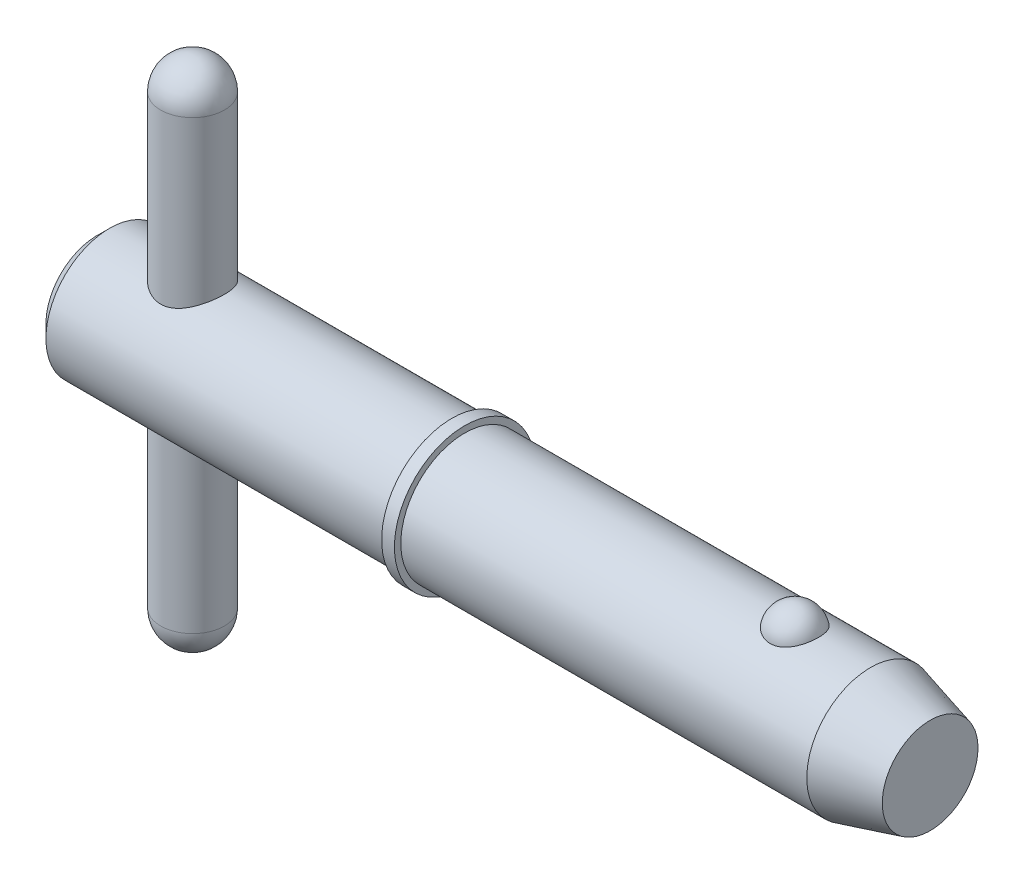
ISO-10303-21;
HEADER;
FILE_DESCRIPTION(('STEP AP214'),'2;1');
FILE_NAME('part.step','',(''),(''),'','','');
FILE_SCHEMA(('AUTOMOTIVE_DESIGN { 1 0 10303 214 1 1 1 1 }'));
ENDSEC;
DATA;
#1=APPLICATION_CONTEXT('core data for automotive mechanical design processes');
#2=APPLICATION_PROTOCOL_DEFINITION('international standard','automotive_design',2000,#1);
#3=PRODUCT_CONTEXT('',#1,'mechanical');
#4=PRODUCT('Part','Part','',(#3));
#5=PRODUCT_RELATED_PRODUCT_CATEGORY('part','',(#4));
#6=PRODUCT_DEFINITION_FORMATION('','',#4);
#7=PRODUCT_DEFINITION_CONTEXT('part definition',#1,'design');
#8=PRODUCT_DEFINITION('design','',#6,#7);
#9=PRODUCT_DEFINITION_SHAPE('','',#8);
#10=(LENGTH_UNIT() NAMED_UNIT(*) SI_UNIT(.MILLI.,.METRE.));
#11=(NAMED_UNIT(*) PLANE_ANGLE_UNIT() SI_UNIT($,.RADIAN.));
#12=(NAMED_UNIT(*) SI_UNIT($,.STERADIAN.) SOLID_ANGLE_UNIT());
#13=UNCERTAINTY_MEASURE_WITH_UNIT(LENGTH_MEASURE(1.E-05),#10,'distance_accuracy_value','');
#14=(GEOMETRIC_REPRESENTATION_CONTEXT(3) GLOBAL_UNCERTAINTY_ASSIGNED_CONTEXT((#13)) GLOBAL_UNIT_ASSIGNED_CONTEXT((#10,
#11,#12)) REPRESENTATION_CONTEXT('',''));
#15=CARTESIAN_POINT('',(0.,0.,0.));
#16=DIRECTION('',(0.,0.,1.));
#17=DIRECTION('',(1.,0.,0.));
#18=AXIS2_PLACEMENT_3D('',#15,#16,#17);
#19=CARTESIAN_POINT('',(4.755,12.7,0.));
#20=DIRECTION('',(0.,-1.,0.));
#21=DIRECTION('',(0.,0.,-1.));
#22=AXIS2_PLACEMENT_3D('',#19,#20,#21);
#23=CYLINDRICAL_SURFACE('',#22,1.585);
#24=CARTESIAN_POINT('',(4.755,-11.115,0.));
#25=DIRECTION('',(0.,-1.,0.));
#26=DIRECTION('',(0.,0.,-1.));
#27=AXIS2_PLACEMENT_3D('',#24,#25,#26);
#28=CIRCLE('',#27,1.585);
#29=CARTESIAN_POINT('',(4.755,-11.115,-1.585));
#30=VERTEX_POINT('',#29);
#31=EDGE_CURVE('P0_E10',#30,#30,#28,.F.);
#32=ORIENTED_EDGE('',*,*,#31,.T.);
#33=EDGE_LOOP('',(#32));
#34=FACE_BOUND('',#33,.T.);
#35=CARTESIAN_POINT('',(4.755,11.115,0.));
#36=DIRECTION('',(0.,-1.,0.));
#37=DIRECTION('',(0.,0.,-1.));
#38=AXIS2_PLACEMENT_3D('',#35,#36,#37);
#39=CIRCLE('',#38,1.585);
#40=CARTESIAN_POINT('',(4.755,11.115,-1.585));
#41=VERTEX_POINT('',#40);
#42=EDGE_CURVE('P0_E21',#41,#41,#39,.T.);
#43=ORIENTED_EDGE('',*,*,#42,.T.);
#44=EDGE_LOOP('',(#43));
#45=FACE_BOUND('',#44,.T.);
#46=ADVANCED_FACE('P0_F14',(#34,#45),#23,.T.);
#47=CARTESIAN_POINT('',(4.755,-11.115,0.));
#48=DIRECTION('',(0.,0.,1.));
#49=DIRECTION('',(1.,0.,0.));
#50=AXIS2_PLACEMENT_3D('',#47,#48,#49);
#51=SPHERICAL_SURFACE('',#50,1.585);
#52=CARTESIAN_POINT('',(4.755,-11.115,0.));
#53=DIRECTION('',(0.,-1.,0.));
#54=DIRECTION('',(0.,0.,-1.));
#55=AXIS2_PLACEMENT_3D('',#52,#53,#54);
#56=SPHERICAL_SURFACE('',#55,1.585);
#57=ORIENTED_EDGE('',*,*,#31,.F.);
#58=EDGE_LOOP('',(#57));
#59=FACE_BOUND('',#58,.T.);
#60=ADVANCED_FACE('P0_F29',(#59),#56,.T.);
#61=CARTESIAN_POINT('',(4.755,11.115,0.));
#62=DIRECTION('',(0.,0.,1.));
#63=DIRECTION('',(1.,0.,0.));
#64=AXIS2_PLACEMENT_3D('',#61,#62,#63);
#65=SPHERICAL_SURFACE('',#64,1.585);
#66=CARTESIAN_POINT('',(4.755,11.115,0.));
#67=DIRECTION('',(0.,-1.,0.));
#68=DIRECTION('',(0.,0.,-1.));
#69=AXIS2_PLACEMENT_3D('',#66,#67,#68);
#70=SPHERICAL_SURFACE('',#69,1.585);
#71=ORIENTED_EDGE('',*,*,#42,.F.);
#72=EDGE_LOOP('',(#71));
#73=FACE_BOUND('',#72,.T.);
#74=ADVANCED_FACE('P0_F16',(#73),#70,.T.);
#75=CLOSED_SHELL('',(#46,#60,#74));
#76=MANIFOLD_SOLID_BREP('P0_B1',#75);
#77=CARTESIAN_POINT('',(0.,0.,0.));
#78=DIRECTION('',(1.,0.,0.));
#79=DIRECTION('',(0.,0.,-1.));
#80=AXIS2_PLACEMENT_3D('',#77,#78,#79);
#81=CYLINDRICAL_SURFACE('',#80,3.175);
#82=CARTESIAN_POINT('',(38.4876846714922,0.,0.));
#83=DIRECTION('',(1.,0.,0.));
#84=DIRECTION('',(0.,0.,-1.));
#85=AXIS2_PLACEMENT_3D('',#82,#83,#84);
#86=CIRCLE('',#85,3.175);
#87=CARTESIAN_POINT('',(38.4876846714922,0.,-3.175));
#88=VERTEX_POINT('',#87);
#89=EDGE_CURVE('P1_E81',#88,#88,#86,.T.);
#90=ORIENTED_EDGE('',*,*,#89,.F.);
#91=EDGE_LOOP('',(#90));
#92=FACE_BOUND('',#91,.T.);
#93=CARTESIAN_POINT('',(18.29,0.,0.));
#94=DIRECTION('',(1.,0.,0.));
#95=DIRECTION('',(0.,0.,-1.));
#96=AXIS2_PLACEMENT_3D('',#93,#94,#95);
#97=CIRCLE('',#96,3.175);
#98=CARTESIAN_POINT('',(18.29,0.,-3.175));
#99=VERTEX_POINT('',#98);
#100=EDGE_CURVE('P1_E85',#99,#99,#97,.T.);
#101=ORIENTED_EDGE('',*,*,#100,.T.);
#102=EDGE_LOOP('',(#101));
#103=FACE_BOUND('',#102,.T.);
#104=CARTESIAN_POINT('',(34.7157276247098,2.92898950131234,1.22541646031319));
#105=CARTESIAN_POINT('',(34.652316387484,2.92899434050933,1.22541146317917));
#106=CARTESIAN_POINT('',(34.5887979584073,2.93112688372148,1.22034641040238));
#107=CARTESIAN_POINT('',(34.4635306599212,2.93942752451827,1.20020949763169));
#108=CARTESIAN_POINT('',(34.4017869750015,2.94560639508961,1.18511092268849));
#109=CARTESIAN_POINT('',(34.2820651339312,2.96127115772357,1.1454035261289));
#110=CARTESIAN_POINT('',(34.2240775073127,2.97074831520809,1.1208198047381));
#111=CARTESIAN_POINT('',(34.1131943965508,2.99197584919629,1.06285154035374));
#112=CARTESIAN_POINT('',(34.0602966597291,3.0037252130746,1.02947091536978));
#113=CARTESIAN_POINT('',(33.9592688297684,3.02865714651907,0.953674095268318));
#114=CARTESIAN_POINT('',(33.9113240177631,3.04187163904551,0.911021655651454));
#115=CARTESIAN_POINT('',(33.8230360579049,3.06808741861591,0.818400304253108));
#116=CARTESIAN_POINT('',(33.7826952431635,3.08108863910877,0.768429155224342));
#117=CARTESIAN_POINT('',(33.7088039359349,3.10614903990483,0.660064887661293));
#118=CARTESIAN_POINT('',(33.6756330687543,3.11814104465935,0.601396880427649));
#119=CARTESIAN_POINT('',(33.6191190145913,3.13926931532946,0.479026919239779));
#120=CARTESIAN_POINT('',(33.5957764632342,3.14840539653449,0.415324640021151));
#121=CARTESIAN_POINT('',(33.5591785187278,3.16298160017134,0.283885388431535));
#122=CARTESIAN_POINT('',(33.5460407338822,3.16837855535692,0.216110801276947));
#123=CARTESIAN_POINT('',(33.5305676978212,3.17475386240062,0.0791367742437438));
#124=CARTESIAN_POINT('',(33.528232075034,3.17573236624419,0.00993738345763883));
#125=CARTESIAN_POINT('',(33.5343886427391,3.17318075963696,-0.127420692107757));
#126=CARTESIAN_POINT('',(33.5428073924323,3.16968122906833,-0.195583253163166));
#127=CARTESIAN_POINT('',(33.5701752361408,3.1585790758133,-0.329413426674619));
#128=CARTESIAN_POINT('',(33.5891245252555,3.15097637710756,-0.395080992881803));
#129=CARTESIAN_POINT('',(33.6372057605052,3.13242485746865,-0.522180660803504));
#130=CARTESIAN_POINT('',(33.6663524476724,3.12147119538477,-0.583606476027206));
#131=CARTESIAN_POINT('',(33.7342352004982,3.09734973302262,-0.700436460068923));
#132=CARTESIAN_POINT('',(33.772972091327,3.08418174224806,-0.755840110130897));
#133=CARTESIAN_POINT('',(33.8594771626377,3.05694884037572,-0.85940454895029));
#134=CARTESIAN_POINT('',(33.9072961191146,3.04287919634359,-0.907521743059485));
#135=CARTESIAN_POINT('',(34.0107353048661,3.01548927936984,-0.994758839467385));
#136=CARTESIAN_POINT('',(34.0663549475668,3.0021689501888,-1.03387941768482));
#137=CARTESIAN_POINT('',(34.1828093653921,2.97810316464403,-1.10126594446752));
#138=CARTESIAN_POINT('',(34.2435182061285,2.96731170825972,-1.12973256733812));
#139=CARTESIAN_POINT('',(34.3693712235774,2.94928934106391,-1.17598467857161));
#140=CARTESIAN_POINT('',(34.4345137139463,2.94205708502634,-1.19377420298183));
#141=CARTESIAN_POINT('',(34.5638562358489,2.93233065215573,-1.21746387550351));
#142=CARTESIAN_POINT('',(34.6279385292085,2.92961621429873,-1.22391763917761));
#143=CARTESIAN_POINT('',(34.7563375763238,2.92855752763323,-1.22644976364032));
#144=CARTESIAN_POINT('',(34.8206542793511,2.93021238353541,-1.22253024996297));
#145=CARTESIAN_POINT('',(34.9455239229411,2.93756851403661,-1.20474140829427));
#146=CARTESIAN_POINT('',(35.006131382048,2.94313790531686,-1.1911962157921));
#147=CARTESIAN_POINT('',(35.1241106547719,2.95756226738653,-1.15491492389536));
#148=CARTESIAN_POINT('',(35.1814822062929,2.96641750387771,-1.13217808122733));
#149=CARTESIAN_POINT('',(35.2927699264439,2.98669918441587,-1.07755083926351));
#150=CARTESIAN_POINT('',(35.3465845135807,2.9981771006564,-1.04547308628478));
#151=CARTESIAN_POINT('',(35.4481473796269,3.02240235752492,-0.973220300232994));
#152=CARTESIAN_POINT('',(35.4958942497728,3.03514999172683,-0.933043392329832));
#153=CARTESIAN_POINT('',(35.5865817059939,3.06131230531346,-0.843372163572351));
#154=CARTESIAN_POINT('',(35.6291588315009,3.07472822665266,-0.793510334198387));
#155=CARTESIAN_POINT('',(35.7056765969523,3.10021106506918,-0.687241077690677));
#156=CARTESIAN_POINT('',(35.7396156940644,3.1122777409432,-0.630832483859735));
#157=CARTESIAN_POINT('',(35.7991209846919,3.134208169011,-0.511059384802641));
#158=CARTESIAN_POINT('',(35.8243892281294,3.14399040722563,-0.447531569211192));
#159=CARTESIAN_POINT('',(35.8645117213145,3.15983820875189,-0.316827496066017));
#160=CARTESIAN_POINT('',(35.8793659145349,3.16590375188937,-0.249651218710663));
#161=CARTESIAN_POINT('',(35.898358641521,3.17370076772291,-0.113549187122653));
#162=CARTESIAN_POINT('',(35.9024966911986,3.17543204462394,-0.044623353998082));
#163=CARTESIAN_POINT('',(35.8999697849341,3.17438372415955,0.0929938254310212));
#164=CARTESIAN_POINT('',(35.893305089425,3.17160423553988,0.161685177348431));
#165=CARTESIAN_POINT('',(35.8693754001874,3.1618438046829,0.296502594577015));
#166=CARTESIAN_POINT('',(35.8521674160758,3.15488546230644,0.36264043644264));
#167=CARTESIAN_POINT('',(35.807547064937,3.13748892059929,0.490896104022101));
#168=CARTESIAN_POINT('',(35.7801339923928,3.12705048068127,0.553013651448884));
#169=CARTESIAN_POINT('',(35.7154626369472,3.10369139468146,0.671876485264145));
#170=CARTESIAN_POINT('',(35.6781467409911,3.0907563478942,0.728587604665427));
#171=CARTESIAN_POINT('',(35.5945246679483,3.06381731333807,0.834653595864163));
#172=CARTESIAN_POINT('',(35.5482189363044,3.04981337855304,0.884008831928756));
#173=CARTESIAN_POINT('',(35.4477184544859,3.02230423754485,0.973916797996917));
#174=CARTESIAN_POINT('',(35.393535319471,3.00879833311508,1.01448227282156));
#175=CARTESIAN_POINT('',(35.2785299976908,2.98383625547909,1.08571550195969));
#176=CARTESIAN_POINT('',(35.2177053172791,2.97238085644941,1.11637952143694));
#177=CARTESIAN_POINT('',(35.0933690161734,2.95329063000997,1.16592590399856));
#178=CARTESIAN_POINT('',(35.0300230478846,2.94553738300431,1.1851790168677));
#179=CARTESIAN_POINT('',(34.9007664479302,2.9342556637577,1.21284802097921));
#180=CARTESIAN_POINT('',(34.8348641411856,2.93071450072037,1.22129647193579));
#181=CARTESIAN_POINT('',(34.751116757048,2.9291525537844,1.22502505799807));
#182=CARTESIAN_POINT('',(34.7334263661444,2.9289881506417,1.22541785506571));
#183=CARTESIAN_POINT('',(34.7157276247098,2.92898950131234,1.22541646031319));
#184=B_SPLINE_CURVE_WITH_KNOTS('',3,(#104,#105,#106,#107,#108,#109,#110,#111,#112,#113,#114,
#115,#116,#117,#118,#119,#120,#121,#122,#123,#124,#125,#126,#127,#128,#129,#130,#131,#132,#133,
#134,#135,#136,#137,#138,#139,#140,#141,#142,#143,#144,#145,#146,#147,#148,#149,#150,#151,#152,
#153,#154,#155,#156,#157,#158,#159,#160,#161,#162,#163,#164,#165,#166,#167,#168,#169,#170,#171,
#172,#173,#174,#175,#176,#177,#178,#179,#180,#181,#182,#183),.UNSPECIFIED.,.T.,.F.,(4,2,2,2,2,2,
2,2,2,2,2,2,2,2,2,2,2,2,2,2,2,2,2,2,2,2,2,2,2,2,2,2,2,2,2,2,2,2,2,4),(0.,0.190186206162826,
0.380880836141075,0.571074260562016,0.761183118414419,0.956866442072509,1.15260970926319,
1.35701770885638,1.56143892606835,1.76818248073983,1.9749189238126,2.18025109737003,
2.38558707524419,2.59122111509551,2.79687285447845,3.00371012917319,3.21053185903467,
3.41323429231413,3.61586005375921,3.80828192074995,4.00066436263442,4.18685798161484,
4.37306665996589,4.5633030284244,4.75358348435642,4.95345287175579,5.15335793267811,
5.3595700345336,5.56578325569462,5.77200579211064,5.97822335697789,6.18333558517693,
6.38846199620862,6.59480900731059,6.8011457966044,7.00718137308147,7.21329457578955,
7.41228022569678,7.61066481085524,7.6637477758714),.UNSPECIFIED.);
#185=CARTESIAN_POINT('',(34.7157276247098,2.92898950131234,1.22541646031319));
#186=VERTEX_POINT('',#185);
#187=EDGE_CURVE('P1_E35',#186,#186,#184,.T.);
#188=ORIENTED_EDGE('',*,*,#187,.T.);
#189=EDGE_LOOP('',(#188));
#190=FACE_BOUND('',#189,.T.);
#191=ADVANCED_FACE('P1_F13',(#92,#103,#190),#81,.T.);
#192=CARTESIAN_POINT('',(0.,0.,0.));
#193=DIRECTION('',(-1.,0.,0.));
#194=DIRECTION('',(0.,0.,1.));
#195=AXIS2_PLACEMENT_3D('',#192,#193,#194);
#196=PLANE('',#195);
#197=CARTESIAN_POINT('',(0.,0.,0.));
#198=DIRECTION('',(1.,0.,0.));
#199=DIRECTION('',(0.,0.,-1.));
#200=AXIS2_PLACEMENT_3D('',#197,#198,#199);
#201=CIRCLE('',#200,2.54);
#202=CARTESIAN_POINT('',(0.,0.,-2.54));
#203=VERTEX_POINT('',#202);
#204=EDGE_CURVE('P1_E9',#203,#203,#201,.T.);
#205=ORIENTED_EDGE('',*,*,#204,.F.);
#206=EDGE_LOOP('',(#205));
#207=FACE_BOUND('',#206,.T.);
#208=ADVANCED_FACE('P1_F15',(#207),#196,.T.);
#209=CARTESIAN_POINT('',(0.634999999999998,0.,0.));
#210=DIRECTION('',(1.,0.,0.));
#211=DIRECTION('',(0.,0.,-1.));
#212=AXIS2_PLACEMENT_3D('',#209,#210,#211);
#213=CONICAL_SURFACE('',#212,3.175,0.78539816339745);
#214=ORIENTED_EDGE('',*,*,#204,.T.);
#215=EDGE_LOOP('',(#214));
#216=FACE_BOUND('',#215,.T.);
#217=CARTESIAN_POINT('',(0.634999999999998,0.,0.));
#218=DIRECTION('',(1.,0.,0.));
#219=DIRECTION('',(0.,0.,-1.));
#220=AXIS2_PLACEMENT_3D('',#217,#218,#219);
#221=CIRCLE('',#220,3.175);
#222=CARTESIAN_POINT('',(0.634999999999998,0.,-3.175));
#223=VERTEX_POINT('',#222);
#224=EDGE_CURVE('P1_E26',#223,#223,#221,.T.);
#225=ORIENTED_EDGE('',*,*,#224,.F.);
#226=EDGE_LOOP('',(#225));
#227=FACE_BOUND('',#226,.T.);
#228=ADVANCED_FACE('P1_F77',(#216,#227),#213,.T.);
#229=CARTESIAN_POINT('',(0.,0.,0.));
#230=DIRECTION('',(1.,0.,0.));
#231=DIRECTION('',(0.,0.,-1.));
#232=AXIS2_PLACEMENT_3D('',#229,#230,#231);
#233=CYLINDRICAL_SURFACE('',#232,3.175);
#234=CARTESIAN_POINT('',(4.755,-2.75107251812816,1.585));
#235=CARTESIAN_POINT('',(4.67238891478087,-2.7510796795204,1.58499425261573));
#236=CARTESIAN_POINT('',(4.58967306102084,-2.75485010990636,1.57849830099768));
#237=CARTESIAN_POINT('',(4.42677850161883,-2.76938647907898,1.55284486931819));
#238=CARTESIAN_POINT('',(4.34660551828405,-2.78016716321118,1.53366069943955));
#239=CARTESIAN_POINT('',(4.19146029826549,-2.80716278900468,1.48366329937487));
#240=CARTESIAN_POINT('',(4.11646293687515,-2.8233488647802,1.45291173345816));
#241=CARTESIAN_POINT('',(3.97271079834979,-2.85928672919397,1.38084067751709));
#242=CARTESIAN_POINT('',(3.90395634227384,-2.87903870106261,1.33952064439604));
#243=CARTESIAN_POINT('',(3.76839976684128,-2.921867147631,1.24350234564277));
#244=CARTESIAN_POINT('',(3.702222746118,-2.94508343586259,1.18798355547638));
#245=CARTESIAN_POINT('',(3.5796334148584,-2.99109588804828,1.06685014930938));
#246=CARTESIAN_POINT('',(3.52322596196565,-3.01389183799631,1.00123054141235));
#247=CARTESIAN_POINT('',(3.41807024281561,-3.05832598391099,0.856373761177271));
#248=CARTESIAN_POINT('',(3.37009053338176,-3.07978367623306,0.776518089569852));
#249=CARTESIAN_POINT('',(3.28853137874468,-3.11730894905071,0.608596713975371));
#250=CARTESIAN_POINT('',(3.25494287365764,-3.1333799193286,0.520536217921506));
#251=CARTESIAN_POINT('',(3.20559401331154,-3.15731341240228,0.345327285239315));
#252=CARTESIAN_POINT('',(3.18873760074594,-3.16567752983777,0.258557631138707));
#253=CARTESIAN_POINT('',(3.16972238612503,-3.17512718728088,0.0830496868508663));
#254=CARTESIAN_POINT('',(3.16755472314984,-3.17621711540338,-0.00568738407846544));
#255=CARTESIAN_POINT('',(3.1775542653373,-3.17123385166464,-0.174372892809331));
#256=CARTESIAN_POINT('',(3.18849502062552,-3.16577346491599,-0.254416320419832));
#257=CARTESIAN_POINT('',(3.22220680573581,-3.14922844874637,-0.411354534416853));
#258=CARTESIAN_POINT('',(3.2449787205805,-3.13814339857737,-0.488249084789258));
#259=CARTESIAN_POINT('',(3.30185558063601,-3.111172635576,-0.638050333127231));
#260=CARTESIAN_POINT('',(3.33611332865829,-3.09522247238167,-0.710886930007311));
#261=CARTESIAN_POINT('',(3.41477890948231,-3.05996035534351,-0.849953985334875));
#262=CARTESIAN_POINT('',(3.45919037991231,-3.04064719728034,-0.916182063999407));
#263=CARTESIAN_POINT('',(3.5617148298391,-2.99832415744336,-1.04681642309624));
#264=CARTESIAN_POINT('',(3.62072497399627,-2.97513741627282,-1.11046186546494));
#265=CARTESIAN_POINT('',(3.7483697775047,-2.92885066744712,-1.22736291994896));
#266=CARTESIAN_POINT('',(3.81701173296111,-2.90575073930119,-1.2806105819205));
#267=CARTESIAN_POINT('',(3.96727993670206,-2.86067370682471,-1.37849835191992));
#268=CARTESIAN_POINT('',(4.04945242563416,-2.83885964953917,-1.42238246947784));
#269=CARTESIAN_POINT('',(4.2213558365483,-2.80110454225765,-1.49537418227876));
#270=CARTESIAN_POINT('',(4.3110787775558,-2.78515738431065,-1.52449715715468));
#271=CARTESIAN_POINT('',(4.48806324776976,-2.76271292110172,-1.56478065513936));
#272=CARTESIAN_POINT('',(4.57495732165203,-2.75556745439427,-1.57718067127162));
#273=CARTESIAN_POINT('',(4.74985771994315,-2.74969306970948,-1.58740564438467));
#274=CARTESIAN_POINT('',(4.8378632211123,-2.75095824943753,-1.58524082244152));
#275=CARTESIAN_POINT('',(5.00227282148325,-2.76107477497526,-1.56753530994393));
#276=CARTESIAN_POINT('',(5.07889680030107,-2.76908515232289,-1.55347662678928));
#277=CARTESIAN_POINT('',(5.22855309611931,-2.79054849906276,-1.51458035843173));
#278=CARTESIAN_POINT('',(5.30158424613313,-2.80400322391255,-1.489739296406));
#279=CARTESIAN_POINT('',(5.44583114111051,-2.83556995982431,-1.42877335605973));
#280=CARTESIAN_POINT('',(5.51680600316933,-2.85386886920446,-1.39217900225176));
#281=CARTESIAN_POINT('',(5.6520174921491,-2.89289503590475,-1.30915485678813));
#282=CARTESIAN_POINT('',(5.71625063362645,-2.91362353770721,-1.26272001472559));
#283=CARTESIAN_POINT('',(5.8445938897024,-2.95830220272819,-1.15451693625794));
#284=CARTESIAN_POINT('',(5.90767560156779,-2.98233004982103,-1.09155543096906));
#285=CARTESIAN_POINT('',(6.0226995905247,-3.02864458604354,-0.955560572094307));
#286=CARTESIAN_POINT('',(6.07463814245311,-3.05093069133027,-0.882523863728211));
#287=CARTESIAN_POINT('',(6.16704288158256,-3.09200671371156,-0.725836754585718));
#288=CARTESIAN_POINT('',(6.20717458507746,-3.11069030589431,-0.64195924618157));
#289=CARTESIAN_POINT('',(6.27235859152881,-3.1416474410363,-0.467442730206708));
#290=CARTESIAN_POINT('',(6.29742409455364,-3.15392659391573,-0.376809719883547));
#291=CARTESIAN_POINT('',(6.32960989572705,-3.16979844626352,-0.200314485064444));
#292=CARTESIAN_POINT('',(6.33816324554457,-3.17408359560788,-0.114775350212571));
#293=CARTESIAN_POINT('',(6.34130309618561,-3.17565001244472,0.0566108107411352));
#294=CARTESIAN_POINT('',(6.33589445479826,-3.17293371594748,0.142457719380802));
#295=CARTESIAN_POINT('',(6.31221457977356,-3.16120608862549,0.306097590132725));
#296=CARTESIAN_POINT('',(6.2948097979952,-3.15261910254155,0.38404960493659));
#297=CARTESIAN_POINT('',(6.24879775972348,-3.13040364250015,0.535801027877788));
#298=CARTESIAN_POINT('',(6.22018889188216,-3.11677444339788,0.609599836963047));
#299=CARTESIAN_POINT('',(6.15130303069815,-3.08497808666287,0.754502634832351));
#300=CARTESIAN_POINT('',(6.11057850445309,-3.0666414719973,0.82535556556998));
#301=CARTESIAN_POINT('',(6.01917980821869,-3.02735012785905,0.95951596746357));
#302=CARTESIAN_POINT('',(5.96850106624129,-3.00639419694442,1.02281994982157));
#303=CARTESIAN_POINT('',(5.8528006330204,-2.96149402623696,1.1467073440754));
#304=CARTESIAN_POINT('',(5.78685463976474,-2.93745961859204,1.20639723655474));
#305=CARTESIAN_POINT('',(5.64552278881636,-2.89084502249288,1.31419099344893));
#306=CARTESIAN_POINT('',(5.57012871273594,-2.8682661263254,1.36228466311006));
#307=CARTESIAN_POINT('',(5.40892145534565,-2.82661780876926,1.44677201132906));
#308=CARTESIAN_POINT('',(5.32285703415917,-2.80767948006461,1.48275497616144));
#309=CARTESIAN_POINT('',(5.14469010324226,-2.77716572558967,1.53916557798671));
#310=CARTESIAN_POINT('',(5.05260892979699,-2.76556569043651,1.55964525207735));
#311=CARTESIAN_POINT('',(4.92544162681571,-2.75613775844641,1.57618070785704));
#312=CARTESIAN_POINT('',(4.89147210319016,-2.75424493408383,1.57948285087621));
#313=CARTESIAN_POINT('',(4.82334103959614,-2.75171079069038,1.58389375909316));
#314=CARTESIAN_POINT('',(4.78917948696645,-2.75106955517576,1.58500237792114));
#315=CARTESIAN_POINT('',(4.755,-2.75107251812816,1.585));
#316=B_SPLINE_CURVE_WITH_KNOTS('',3,(#234,#235,#236,#237,#238,#239,#240,#241,#242,#243,#244,
#245,#246,#247,#248,#249,#250,#251,#252,#253,#254,#255,#256,#257,#258,#259,#260,#261,#262,#263,
#264,#265,#266,#267,#268,#269,#270,#271,#272,#273,#274,#275,#276,#277,#278,#279,#280,#281,#282,
#283,#284,#285,#286,#287,#288,#289,#290,#291,#292,#293,#294,#295,#296,#297,#298,#299,#300,#301,
#302,#303,#304,#305,#306,#307,#308,#309,#310,#311,#312,#313,#314,#315),.UNSPECIFIED.,.T.,.F.,(4,
2,2,2,2,2,2,2,2,2,2,2,2,2,2,2,2,2,2,2,2,2,2,2,2,2,2,2,2,2,2,2,2,2,2,2,2,2,2,2,4),(0.,
0.247689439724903,0.495901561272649,0.742808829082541,0.989728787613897,1.25694656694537,
1.52429683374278,1.80959781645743,2.0947189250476,2.35960564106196,2.62433255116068,
2.86610932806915,3.1079041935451,3.35305262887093,3.59828902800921,3.86665310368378,
4.13522157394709,4.4207514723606,4.70598326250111,4.9686344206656,5.23110127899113,
5.46499114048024,5.69895647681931,5.94376186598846,6.1886932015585,6.46438263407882,
6.74016408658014,7.0231370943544,7.30586181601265,7.5626977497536,7.81944433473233,
8.05935987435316,8.29930993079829,8.54954401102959,8.79989329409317,9.07508848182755,
9.35052473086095,9.63453318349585,9.91758407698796,10.0200561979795,10.1225351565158),.UNSPECIFIED.);
#317=CARTESIAN_POINT('',(4.755,-2.75107251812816,1.585));
#318=VERTEX_POINT('',#317);
#319=EDGE_CURVE('P1_E17',#318,#318,#316,.T.);
#320=ORIENTED_EDGE('',*,*,#319,.F.);
#321=EDGE_LOOP('',(#320));
#322=FACE_BOUND('',#321,.T.);
#323=CARTESIAN_POINT('',(4.755,2.75107251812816,1.585));
#324=CARTESIAN_POINT('',(4.83761108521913,2.7510796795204,1.58499425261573));
#325=CARTESIAN_POINT('',(4.92032693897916,2.75485010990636,1.57849830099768));
#326=CARTESIAN_POINT('',(5.08322149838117,2.76938647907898,1.55284486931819));
#327=CARTESIAN_POINT('',(5.16339448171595,2.78016716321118,1.53366069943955));
#328=CARTESIAN_POINT('',(5.31853970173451,2.80716278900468,1.48366329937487));
#329=CARTESIAN_POINT('',(5.39353706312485,2.8233488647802,1.45291173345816));
#330=CARTESIAN_POINT('',(5.53728920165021,2.85928672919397,1.38084067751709));
#331=CARTESIAN_POINT('',(5.60604365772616,2.87903870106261,1.33952064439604));
#332=CARTESIAN_POINT('',(5.74160023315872,2.921867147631,1.24350234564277));
#333=CARTESIAN_POINT('',(5.807777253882,2.94508343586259,1.18798355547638));
#334=CARTESIAN_POINT('',(5.9303665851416,2.99109588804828,1.06685014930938));
#335=CARTESIAN_POINT('',(5.98677403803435,3.01389183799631,1.00123054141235));
#336=CARTESIAN_POINT('',(6.09192975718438,3.05832598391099,0.85637376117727));
#337=CARTESIAN_POINT('',(6.13990946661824,3.07978367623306,0.776518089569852));
#338=CARTESIAN_POINT('',(6.22146862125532,3.11730894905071,0.608596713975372));
#339=CARTESIAN_POINT('',(6.25505712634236,3.1333799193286,0.520536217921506));
#340=CARTESIAN_POINT('',(6.30440598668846,3.15731341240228,0.345327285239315));
#341=CARTESIAN_POINT('',(6.32126239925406,3.16567752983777,0.258557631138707));
#342=CARTESIAN_POINT('',(6.34027761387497,3.17512718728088,0.0830496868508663));
#343=CARTESIAN_POINT('',(6.34244527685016,3.17621711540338,-0.00568738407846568));
#344=CARTESIAN_POINT('',(6.3324457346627,3.17123385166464,-0.174372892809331));
#345=CARTESIAN_POINT('',(6.32150497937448,3.16577346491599,-0.254416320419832));
#346=CARTESIAN_POINT('',(6.28779319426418,3.14922844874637,-0.411354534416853));
#347=CARTESIAN_POINT('',(6.2650212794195,3.13814339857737,-0.488249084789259));
#348=CARTESIAN_POINT('',(6.20814441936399,3.111172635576,-0.638050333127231));
#349=CARTESIAN_POINT('',(6.17388667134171,3.09522247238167,-0.710886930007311));
#350=CARTESIAN_POINT('',(6.09522109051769,3.05996035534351,-0.849953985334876));
#351=CARTESIAN_POINT('',(6.05080962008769,3.04064719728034,-0.916182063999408));
#352=CARTESIAN_POINT('',(5.9482851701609,2.99832415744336,-1.04681642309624));
#353=CARTESIAN_POINT('',(5.88927502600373,2.97513741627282,-1.11046186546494));
#354=CARTESIAN_POINT('',(5.7616302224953,2.92885066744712,-1.22736291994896));
#355=CARTESIAN_POINT('',(5.69298826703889,2.90575073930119,-1.2806105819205));
#356=CARTESIAN_POINT('',(5.54272006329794,2.86067370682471,-1.37849835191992));
#357=CARTESIAN_POINT('',(5.46054757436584,2.83885964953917,-1.42238246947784));
#358=CARTESIAN_POINT('',(5.2886441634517,2.80110454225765,-1.49537418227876));
#359=CARTESIAN_POINT('',(5.19892122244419,2.78515738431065,-1.52449715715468));
#360=CARTESIAN_POINT('',(5.02193675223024,2.76271292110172,-1.56478065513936));
#361=CARTESIAN_POINT('',(4.93504267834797,2.75556745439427,-1.57718067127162));
#362=CARTESIAN_POINT('',(4.76014228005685,2.74969306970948,-1.58740564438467));
#363=CARTESIAN_POINT('',(4.6721367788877,2.75095824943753,-1.58524082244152));
#364=CARTESIAN_POINT('',(4.50772717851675,2.76107477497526,-1.56753530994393));
#365=CARTESIAN_POINT('',(4.43110319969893,2.76908515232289,-1.55347662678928));
#366=CARTESIAN_POINT('',(4.28144690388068,2.79054849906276,-1.51458035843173));
#367=CARTESIAN_POINT('',(4.20841575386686,2.80400322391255,-1.489739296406));
#368=CARTESIAN_POINT('',(4.06416885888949,2.83556995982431,-1.42877335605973));
#369=CARTESIAN_POINT('',(3.99319399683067,2.85386886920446,-1.39217900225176));
#370=CARTESIAN_POINT('',(3.8579825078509,2.89289503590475,-1.30915485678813));
#371=CARTESIAN_POINT('',(3.79374936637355,2.91362353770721,-1.26272001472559));
#372=CARTESIAN_POINT('',(3.6654061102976,2.95830220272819,-1.15451693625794));
#373=CARTESIAN_POINT('',(3.60232439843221,2.98233004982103,-1.09155543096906));
#374=CARTESIAN_POINT('',(3.4873004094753,3.02864458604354,-0.955560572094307));
#375=CARTESIAN_POINT('',(3.43536185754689,3.05093069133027,-0.88252386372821));
#376=CARTESIAN_POINT('',(3.34295711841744,3.09200671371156,-0.725836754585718));
#377=CARTESIAN_POINT('',(3.30282541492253,3.11069030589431,-0.64195924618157));
#378=CARTESIAN_POINT('',(3.23764140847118,3.14164744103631,-0.467442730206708));
#379=CARTESIAN_POINT('',(3.21257590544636,3.15392659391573,-0.376809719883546));
#380=CARTESIAN_POINT('',(3.18039010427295,3.16979844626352,-0.200314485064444));
#381=CARTESIAN_POINT('',(3.17183675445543,3.17408359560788,-0.114775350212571));
#382=CARTESIAN_POINT('',(3.16869690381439,3.17565001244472,0.0566108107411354));
#383=CARTESIAN_POINT('',(3.17410554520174,3.17293371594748,0.142457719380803));
#384=CARTESIAN_POINT('',(3.19778542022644,3.16120608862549,0.306097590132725));
#385=CARTESIAN_POINT('',(3.2151902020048,3.15261910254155,0.384049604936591));
#386=CARTESIAN_POINT('',(3.26120224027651,3.13040364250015,0.535801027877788));
#387=CARTESIAN_POINT('',(3.28981110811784,3.11677444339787,0.609599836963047));
#388=CARTESIAN_POINT('',(3.35869696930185,3.08497808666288,0.754502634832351));
#389=CARTESIAN_POINT('',(3.39942149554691,3.0666414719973,0.82535556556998));
#390=CARTESIAN_POINT('',(3.49082019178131,3.02735012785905,0.95951596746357));
#391=CARTESIAN_POINT('',(3.54149893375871,3.00639419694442,1.02281994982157));
#392=CARTESIAN_POINT('',(3.6571993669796,2.96149402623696,1.1467073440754));
#393=CARTESIAN_POINT('',(3.72314536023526,2.93745961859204,1.20639723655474));
#394=CARTESIAN_POINT('',(3.86447721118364,2.89084502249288,1.31419099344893));
#395=CARTESIAN_POINT('',(3.93987128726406,2.8682661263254,1.36228466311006));
#396=CARTESIAN_POINT('',(4.10107854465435,2.82661780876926,1.44677201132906));
#397=CARTESIAN_POINT('',(4.18714296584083,2.80767948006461,1.48275497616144));
#398=CARTESIAN_POINT('',(4.36530989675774,2.77716572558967,1.53916557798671));
#399=CARTESIAN_POINT('',(4.45739107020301,2.76556569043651,1.55964525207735));
#400=CARTESIAN_POINT('',(4.58455837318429,2.75613775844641,1.57618070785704));
#401=CARTESIAN_POINT('',(4.61852789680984,2.75424493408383,1.57948285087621));
#402=CARTESIAN_POINT('',(4.68665896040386,2.75171079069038,1.58389375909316));
#403=CARTESIAN_POINT('',(4.72082051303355,2.75106955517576,1.58500237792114));
#404=CARTESIAN_POINT('',(4.755,2.75107251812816,1.585));
#405=B_SPLINE_CURVE_WITH_KNOTS('',3,(#323,#324,#325,#326,#327,#328,#329,#330,#331,#332,#333,
#334,#335,#336,#337,#338,#339,#340,#341,#342,#343,#344,#345,#346,#347,#348,#349,#350,#351,#352,
#353,#354,#355,#356,#357,#358,#359,#360,#361,#362,#363,#364,#365,#366,#367,#368,#369,#370,#371,
#372,#373,#374,#375,#376,#377,#378,#379,#380,#381,#382,#383,#384,#385,#386,#387,#388,#389,#390,
#391,#392,#393,#394,#395,#396,#397,#398,#399,#400,#401,#402,#403,#404),.UNSPECIFIED.,.T.,.F.,(4,
2,2,2,2,2,2,2,2,2,2,2,2,2,2,2,2,2,2,2,2,2,2,2,2,2,2,2,2,2,2,2,2,2,2,2,2,2,2,2,4),(0.,
0.247689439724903,0.495901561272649,0.742808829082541,0.989728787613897,1.25694656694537,
1.52429683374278,1.80959781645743,2.0947189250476,2.35960564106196,2.62433255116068,
2.86610932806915,3.1079041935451,3.35305262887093,3.59828902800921,3.86665310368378,
4.13522157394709,4.4207514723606,4.70598326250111,4.9686344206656,5.23110127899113,
5.46499114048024,5.69895647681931,5.94376186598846,6.1886932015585,6.46438263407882,
6.74016408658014,7.0231370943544,7.30586181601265,7.5626977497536,7.81944433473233,
8.05935987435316,8.29930993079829,8.54954401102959,8.79989329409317,9.07508848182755,
9.35052473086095,9.63453318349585,9.91758407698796,10.0200561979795,10.1225351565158),.UNSPECIFIED.);
#406=CARTESIAN_POINT('',(4.755,2.75107251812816,1.585));
#407=VERTEX_POINT('',#406);
#408=EDGE_CURVE('P1_E43',#407,#407,#405,.T.);
#409=ORIENTED_EDGE('',*,*,#408,.F.);
#410=EDGE_LOOP('',(#409));
#411=FACE_BOUND('',#410,.T.);
#412=ORIENTED_EDGE('',*,*,#224,.T.);
#413=EDGE_LOOP('',(#412));
#414=FACE_BOUND('',#413,.T.);
#415=CARTESIAN_POINT('',(17.655,0.,0.));
#416=DIRECTION('',(1.,0.,0.));
#417=DIRECTION('',(0.,0.,-1.));
#418=AXIS2_PLACEMENT_3D('',#415,#416,#417);
#419=CIRCLE('',#418,3.175);
#420=CARTESIAN_POINT('',(17.655,0.,-3.175));
#421=VERTEX_POINT('',#420);
#422=EDGE_CURVE('P1_E31',#421,#421,#419,.T.);
#423=ORIENTED_EDGE('',*,*,#422,.F.);
#424=EDGE_LOOP('',(#423));
#425=FACE_BOUND('',#424,.T.);
#426=ADVANCED_FACE('P1_F103',(#322,#411,#414,#425),#233,.T.);
#427=CARTESIAN_POINT('',(17.655,3.175,0.));
#428=DIRECTION('',(-1.,0.,0.));
#429=DIRECTION('',(0.,0.,1.));
#430=AXIS2_PLACEMENT_3D('',#427,#428,#429);
#431=PLANE('',#430);
#432=ORIENTED_EDGE('',*,*,#422,.T.);
#433=EDGE_LOOP('',(#432));
#434=FACE_BOUND('',#433,.T.);
#435=CARTESIAN_POINT('',(17.655,0.,0.));
#436=DIRECTION('',(1.,0.,0.));
#437=DIRECTION('',(0.,0.,-1.));
#438=AXIS2_PLACEMENT_3D('',#435,#436,#437);
#439=CIRCLE('',#438,3.4925);
#440=CARTESIAN_POINT('',(17.655,0.,-3.4925));
#441=VERTEX_POINT('',#440);
#442=EDGE_CURVE('P1_E91',#441,#441,#439,.T.);
#443=ORIENTED_EDGE('',*,*,#442,.F.);
#444=EDGE_LOOP('',(#443));
#445=FACE_BOUND('',#444,.T.);
#446=ADVANCED_FACE('P1_F100',(#434,#445),#431,.T.);
#447=CARTESIAN_POINT('',(0.,0.,0.));
#448=DIRECTION('',(1.,0.,0.));
#449=DIRECTION('',(0.,0.,-1.));
#450=AXIS2_PLACEMENT_3D('',#447,#448,#449);
#451=CYLINDRICAL_SURFACE('',#450,3.4925);
#452=ORIENTED_EDGE('',*,*,#442,.T.);
#453=EDGE_LOOP('',(#452));
#454=FACE_BOUND('',#453,.T.);
#455=CARTESIAN_POINT('',(18.29,0.,0.));
#456=DIRECTION('',(1.,0.,0.));
#457=DIRECTION('',(0.,0.,-1.));
#458=AXIS2_PLACEMENT_3D('',#455,#456,#457);
#459=CIRCLE('',#458,3.4925);
#460=CARTESIAN_POINT('',(18.29,0.,-3.4925));
#461=VERTEX_POINT('',#460);
#462=EDGE_CURVE('P1_E88',#461,#461,#459,.T.);
#463=ORIENTED_EDGE('',*,*,#462,.F.);
#464=EDGE_LOOP('',(#463));
#465=FACE_BOUND('',#464,.T.);
#466=ADVANCED_FACE('P1_F68',(#454,#465),#451,.T.);
#467=CARTESIAN_POINT('',(18.29,3.4925,0.));
#468=DIRECTION('',(1.,0.,0.));
#469=DIRECTION('',(0.,0.,-1.));
#470=AXIS2_PLACEMENT_3D('',#467,#468,#469);
#471=PLANE('',#470);
#472=ORIENTED_EDGE('',*,*,#462,.T.);
#473=EDGE_LOOP('',(#472));
#474=FACE_BOUND('',#473,.T.);
#475=ORIENTED_EDGE('',*,*,#100,.F.);
#476=EDGE_LOOP('',(#475));
#477=FACE_BOUND('',#476,.T.);
#478=ADVANCED_FACE('P1_F62',(#474,#477),#471,.T.);
#479=CARTESIAN_POINT('',(41.45,0.,0.));
#480=DIRECTION('',(-1.,0.,0.));
#481=DIRECTION('',(0.,0.,1.));
#482=AXIS2_PLACEMENT_3D('',#479,#480,#481);
#483=CONICAL_SURFACE('',#482,2.38125,0.26179938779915);
#484=ORIENTED_EDGE('',*,*,#89,.T.);
#485=EDGE_LOOP('',(#484));
#486=FACE_BOUND('',#485,.T.);
#487=CARTESIAN_POINT('',(41.45,0.,0.));
#488=DIRECTION('',(1.,0.,0.));
#489=DIRECTION('',(0.,0.,-1.));
#490=AXIS2_PLACEMENT_3D('',#487,#488,#489);
#491=CIRCLE('',#490,2.38125);
#492=CARTESIAN_POINT('',(41.45,0.,-2.38125));
#493=VERTEX_POINT('',#492);
#494=EDGE_CURVE('P1_E42',#493,#493,#491,.T.);
#495=ORIENTED_EDGE('',*,*,#494,.F.);
#496=EDGE_LOOP('',(#495));
#497=FACE_BOUND('',#496,.T.);
#498=ADVANCED_FACE('P1_F59',(#486,#497),#483,.T.);
#499=CARTESIAN_POINT('',(41.45,2.38125,0.));
#500=DIRECTION('',(1.,0.,0.));
#501=DIRECTION('',(0.,0.,-1.));
#502=AXIS2_PLACEMENT_3D('',#499,#500,#501);
#503=PLANE('',#502);
#504=ORIENTED_EDGE('',*,*,#494,.T.);
#505=EDGE_LOOP('',(#504));
#506=FACE_BOUND('',#505,.T.);
#507=ADVANCED_FACE('P1_F55',(#506),#503,.T.);
#508=CARTESIAN_POINT('',(34.7157276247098,2.8575,0.));
#509=DIRECTION('',(-1.,0.,0.));
#510=DIRECTION('',(0.,1.,0.));
#511=AXIS2_PLACEMENT_3D('',#508,#509,#510);
#512=SPHERICAL_SURFACE('',#511,1.22749999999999);
#513=ORIENTED_EDGE('',*,*,#187,.F.);
#514=EDGE_LOOP('',(#513));
#515=FACE_BOUND('',#514,.T.);
#516=ADVANCED_FACE('P1_F50',(#515),#512,.T.);
#517=CARTESIAN_POINT('',(4.755,-3.4925,0.));
#518=DIRECTION('',(0.,1.,0.));
#519=DIRECTION('',(0.,0.,1.));
#520=AXIS2_PLACEMENT_3D('',#517,#518,#519);
#521=CYLINDRICAL_SURFACE('',#520,1.585);
#522=ORIENTED_EDGE('',*,*,#319,.T.);
#523=EDGE_LOOP('',(#522));
#524=FACE_BOUND('',#523,.T.);
#525=ORIENTED_EDGE('',*,*,#408,.T.);
#526=EDGE_LOOP('',(#525));
#527=FACE_BOUND('',#526,.T.);
#528=ADVANCED_FACE('P1_F54',(#524,#527),#521,.F.);
#529=CLOSED_SHELL('',(#191,#208,#228,#426,#446,#466,#478,#498,#507,#516,#528));
#530=MANIFOLD_SOLID_BREP('P1_B1',#529);
#531=ADVANCED_BREP_SHAPE_REPRESENTATION('',(#18,#76,#530),#14);
#532=SHAPE_DEFINITION_REPRESENTATION(#9,#531);
ENDSEC;
END-ISO-10303-21;
